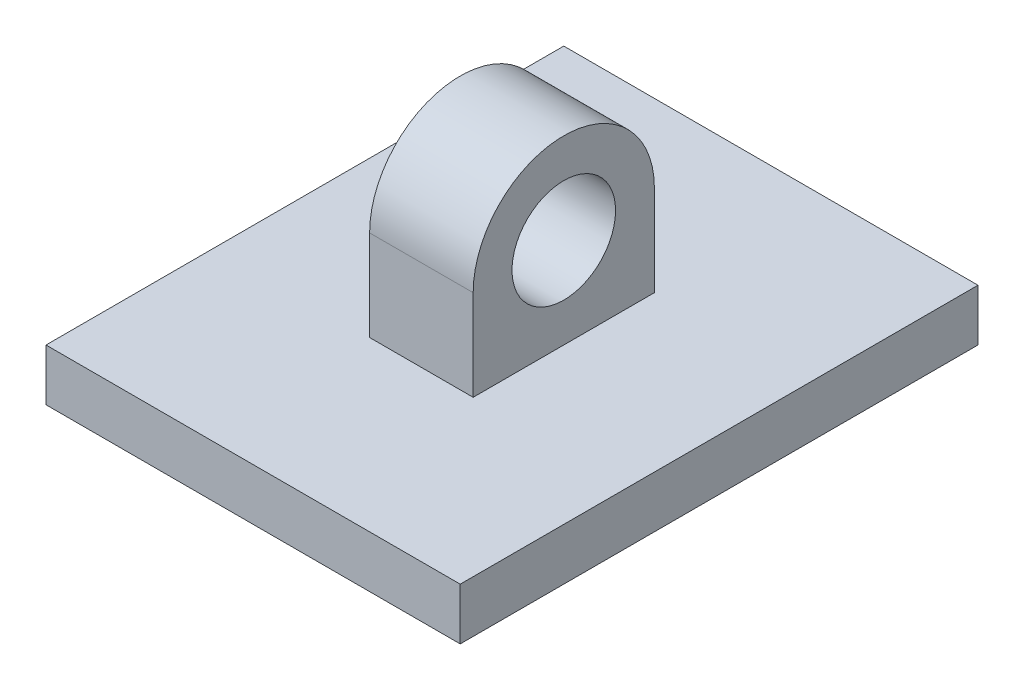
from build123d import *

# Parameters (mm, degrees)
SKETCH1_R           = 50
BOSS_EXTRUDE1_DEPTH = 50
BOSS_EXTRUDE2_DEPTH = 200


with BuildPart() as part:
    # Sketch1 → Boss-Extrude1 (new, symmetric)
    with BuildSketch(Plane(origin=(0, 0, 0), x_dir=(0, 0, -1), z_dir=(1, 0, 0))):
        with BuildLine():
            Line((87.5, 0), (87.5, -87.5))
            Line((87.5, -87.5), (-87.5, -87.5))
            Line((-87.5, -87.5), (-87.5, 0))
            ThreePointArc((-87.5, 0), (0, 87.5), (87.5, 0))
        make_face()
        Circle(SKETCH1_R, mode=Mode.SUBTRACT)
    extrude(amount=BOSS_EXTRUDE1_DEPTH, both=True)

    # Sketch1_3 → Boss-Extrude2 (add, symmetric)
    with BuildSketch(Plane(origin=(0, 0, 0), x_dir=(0, 0, -1), z_dir=(1, 0, 0))):
        Polygon((-87.5, -87.5), (87.5, -87.5), (250, -87.5), (250, -137.5), (-250, -137.5), (-250, -87.5), align=None)
    extrude(amount=BOSS_EXTRUDE2_DEPTH, both=True)


solid = part.part
